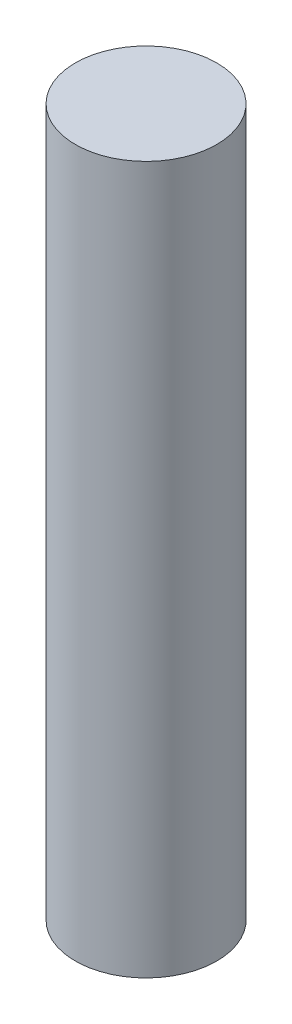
ISO-10303-21;
HEADER;
FILE_DESCRIPTION(('STEP AP214'),'2;1');
FILE_NAME('part.step','',(''),(''),'','','');
FILE_SCHEMA(('AUTOMOTIVE_DESIGN { 1 0 10303 214 1 1 1 1 }'));
ENDSEC;
DATA;
#1=APPLICATION_CONTEXT('core data for automotive mechanical design processes');
#2=APPLICATION_PROTOCOL_DEFINITION('international standard','automotive_design',2000,#1);
#3=PRODUCT_CONTEXT('',#1,'mechanical');
#4=PRODUCT('Part','Part','',(#3));
#5=PRODUCT_RELATED_PRODUCT_CATEGORY('part','',(#4));
#6=PRODUCT_DEFINITION_FORMATION('','',#4);
#7=PRODUCT_DEFINITION_CONTEXT('part definition',#1,'design');
#8=PRODUCT_DEFINITION('design','',#6,#7);
#9=PRODUCT_DEFINITION_SHAPE('','',#8);
#10=(LENGTH_UNIT() NAMED_UNIT(*) SI_UNIT(.MILLI.,.METRE.));
#11=(NAMED_UNIT(*) PLANE_ANGLE_UNIT() SI_UNIT($,.RADIAN.));
#12=(NAMED_UNIT(*) SI_UNIT($,.STERADIAN.) SOLID_ANGLE_UNIT());
#13=UNCERTAINTY_MEASURE_WITH_UNIT(LENGTH_MEASURE(1.E-05),#10,'distance_accuracy_value','');
#14=(GEOMETRIC_REPRESENTATION_CONTEXT(3) GLOBAL_UNCERTAINTY_ASSIGNED_CONTEXT((#13)) GLOBAL_UNIT_ASSIGNED_CONTEXT((#10,
#11,#12)) REPRESENTATION_CONTEXT('',''));
#15=CARTESIAN_POINT('',(0.,0.,0.));
#16=DIRECTION('',(0.,0.,1.));
#17=DIRECTION('',(1.,0.,0.));
#18=AXIS2_PLACEMENT_3D('',#15,#16,#17);
#19=CARTESIAN_POINT('',(0.,19.05,0.));
#20=DIRECTION('',(0.,-1.,0.));
#21=DIRECTION('',(0.,0.,-1.));
#22=AXIS2_PLACEMENT_3D('',#19,#20,#21);
#23=CYLINDRICAL_SURFACE('',#22,3.81);
#24=CARTESIAN_POINT('',(0.,19.05,0.));
#25=DIRECTION('',(0.,1.,0.));
#26=DIRECTION('',(0.,0.,1.));
#27=AXIS2_PLACEMENT_3D('',#24,#25,#26);
#28=CIRCLE('',#27,3.81);
#29=CARTESIAN_POINT('',(0.,19.05,-3.81));
#30=VERTEX_POINT('',#29);
#31=EDGE_CURVE('E10',#30,#30,#28,.T.);
#32=CARTESIAN_POINT('',(0.,-19.05,0.));
#33=DIRECTION('',(0.,1.,0.));
#34=DIRECTION('',(0.,0.,1.));
#35=AXIS2_PLACEMENT_3D('',#32,#33,#34);
#36=CIRCLE('',#35,3.81);
#37=CARTESIAN_POINT('',(0.,-19.05,-3.81));
#38=VERTEX_POINT('',#37);
#39=EDGE_CURVE('E46',#38,#38,#36,.T.);
#40=CARTESIAN_POINT('',(0.,19.05,-3.81));
#41=CARTESIAN_POINT('',(0.,18.653125,-3.81));
#42=CARTESIAN_POINT('',(0.,18.25625,-3.81));
#43=CARTESIAN_POINT('',(0.,17.4625,-3.81));
#44=CARTESIAN_POINT('',(0.,17.065625,-3.81));
#45=CARTESIAN_POINT('',(0.,16.271875,-3.81));
#46=CARTESIAN_POINT('',(0.,15.875,-3.81));
#47=CARTESIAN_POINT('',(0.,15.08125,-3.81));
#48=CARTESIAN_POINT('',(0.,14.684375,-3.81));
#49=CARTESIAN_POINT('',(0.,13.890625,-3.81));
#50=CARTESIAN_POINT('',(0.,13.49375,-3.81));
#51=CARTESIAN_POINT('',(0.,12.7,-3.81));
#52=CARTESIAN_POINT('',(0.,12.303125,-3.81));
#53=CARTESIAN_POINT('',(0.,11.509375,-3.81));
#54=CARTESIAN_POINT('',(0.,11.1125,-3.81));
#55=CARTESIAN_POINT('',(0.,10.31875,-3.81));
#56=CARTESIAN_POINT('',(0.,9.921875,-3.81));
#57=CARTESIAN_POINT('',(0.,9.128125,-3.81));
#58=CARTESIAN_POINT('',(0.,8.73125,-3.81));
#59=CARTESIAN_POINT('',(0.,7.9375,-3.81));
#60=CARTESIAN_POINT('',(0.,7.540625,-3.81));
#61=CARTESIAN_POINT('',(0.,6.746875,-3.81));
#62=CARTESIAN_POINT('',(0.,6.35,-3.81));
#63=CARTESIAN_POINT('',(0.,5.55625,-3.81));
#64=CARTESIAN_POINT('',(0.,5.159375,-3.81));
#65=CARTESIAN_POINT('',(0.,4.365625,-3.81));
#66=CARTESIAN_POINT('',(0.,3.96875,-3.81));
#67=CARTESIAN_POINT('',(0.,3.175,-3.81));
#68=CARTESIAN_POINT('',(0.,2.778125,-3.81));
#69=CARTESIAN_POINT('',(0.,1.984375,-3.81));
#70=CARTESIAN_POINT('',(0.,1.5875,-3.81));
#71=CARTESIAN_POINT('',(0.,0.79375,-3.81));
#72=CARTESIAN_POINT('',(0.,0.396875,-3.81));
#73=CARTESIAN_POINT('',(0.,-0.396875,-3.81));
#74=CARTESIAN_POINT('',(0.,-0.79375,-3.81));
#75=CARTESIAN_POINT('',(0.,-1.5875,-3.81));
#76=CARTESIAN_POINT('',(0.,-1.984375,-3.81));
#77=CARTESIAN_POINT('',(0.,-2.778125,-3.81));
#78=CARTESIAN_POINT('',(0.,-3.175,-3.81));
#79=CARTESIAN_POINT('',(0.,-3.96875,-3.81));
#80=CARTESIAN_POINT('',(0.,-4.365625,-3.81));
#81=CARTESIAN_POINT('',(0.,-5.159375,-3.81));
#82=CARTESIAN_POINT('',(0.,-5.55625,-3.81));
#83=CARTESIAN_POINT('',(0.,-6.35,-3.81));
#84=CARTESIAN_POINT('',(0.,-6.746875,-3.81));
#85=CARTESIAN_POINT('',(0.,-7.540625,-3.81));
#86=CARTESIAN_POINT('',(0.,-7.9375,-3.81));
#87=CARTESIAN_POINT('',(0.,-8.73125,-3.81));
#88=CARTESIAN_POINT('',(0.,-9.128125,-3.81));
#89=CARTESIAN_POINT('',(0.,-9.921875,-3.81));
#90=CARTESIAN_POINT('',(0.,-10.31875,-3.81));
#91=CARTESIAN_POINT('',(0.,-11.1125,-3.81));
#92=CARTESIAN_POINT('',(0.,-11.509375,-3.81));
#93=CARTESIAN_POINT('',(0.,-12.303125,-3.81));
#94=CARTESIAN_POINT('',(0.,-12.7,-3.81));
#95=CARTESIAN_POINT('',(0.,-13.49375,-3.81));
#96=CARTESIAN_POINT('',(0.,-13.890625,-3.81));
#97=CARTESIAN_POINT('',(0.,-14.684375,-3.81));
#98=CARTESIAN_POINT('',(0.,-15.08125,-3.81));
#99=CARTESIAN_POINT('',(0.,-15.875,-3.81));
#100=CARTESIAN_POINT('',(0.,-16.271875,-3.81));
#101=CARTESIAN_POINT('',(0.,-17.065625,-3.81));
#102=CARTESIAN_POINT('',(0.,-17.4625,-3.81));
#103=CARTESIAN_POINT('',(0.,-18.25625,-3.81));
#104=CARTESIAN_POINT('',(0.,-18.653125,-3.81));
#105=CARTESIAN_POINT('',(0.,-19.05,-3.81));
#106=B_SPLINE_CURVE_WITH_KNOTS('',3,(#40,#41,#42,#43,#44,#45,#46,#47,#48,#49,#50,#51,#52,#53,
#54,#55,#56,#57,#58,#59,#60,#61,#62,#63,#64,#65,#66,#67,#68,#69,#70,#71,#72,#73,#74,#75,#76,#77,
#78,#79,#80,#81,#82,#83,#84,#85,#86,#87,#88,#89,#90,#91,#92,#93,#94,#95,#96,#97,#98,#99,#100,
#101,#102,#103,#104,#105),.UNSPECIFIED.,.F.,.F.,(4,2,2,2,2,2,2,2,2,2,2,2,2,2,2,2,2,2,2,2,2,2,2,
2,2,2,2,2,2,2,2,2,4),(0.,1.190625,2.38125,3.571875,4.7625,5.953125,7.14375,8.334375,9.525,
10.715625,11.90625,13.096875,14.2875,15.478125,16.66875,17.859375,19.05,20.240625,21.43125,
22.621875,23.8125,25.003125,26.19375,27.384375,28.575,29.765625,30.95625,32.146875,33.3375,
34.528125,35.71875,36.909375,38.1),.UNSPECIFIED.);
#107=EDGE_CURVE('BSEAM43',#30,#38,#106,.T.);
#108=ORIENTED_EDGE('',*,*,#31,.F.);
#109=ORIENTED_EDGE('',*,*,#39,.T.);
#110=ORIENTED_EDGE('',*,*,#107,.T.);
#111=ORIENTED_EDGE('',*,*,#107,.F.);
#112=EDGE_LOOP('',(#108,#110,#109,#111));
#113=FACE_BOUND('',#112,.T.);
#114=ADVANCED_FACE('F43',(#113),#23,.T.);
#115=CARTESIAN_POINT('',(0.,19.05,0.));
#116=DIRECTION('',(0.,1.,0.));
#117=DIRECTION('',(0.,0.,1.));
#118=AXIS2_PLACEMENT_3D('',#115,#116,#117);
#119=PLANE('',#118);
#120=ORIENTED_EDGE('',*,*,#31,.T.);
#121=EDGE_LOOP('',(#120));
#122=FACE_BOUND('',#121,.T.);
#123=ADVANCED_FACE('F60',(#122),#119,.T.);
#124=CARTESIAN_POINT('',(0.,-19.05,0.));
#125=DIRECTION('',(0.,1.,0.));
#126=DIRECTION('',(0.,0.,1.));
#127=AXIS2_PLACEMENT_3D('',#124,#125,#126);
#128=PLANE('',#127);
#129=ORIENTED_EDGE('',*,*,#39,.F.);
#130=EDGE_LOOP('',(#129));
#131=FACE_BOUND('',#130,.T.);
#132=ADVANCED_FACE('F58',(#131),#128,.F.);
#133=CLOSED_SHELL('',(#114,#123,#132));
#134=MANIFOLD_SOLID_BREP('B2',#133);
#135=ADVANCED_BREP_SHAPE_REPRESENTATION('',(#18,#134),#14);
#136=SHAPE_DEFINITION_REPRESENTATION(#9,#135);
ENDSEC;
END-ISO-10303-21;
